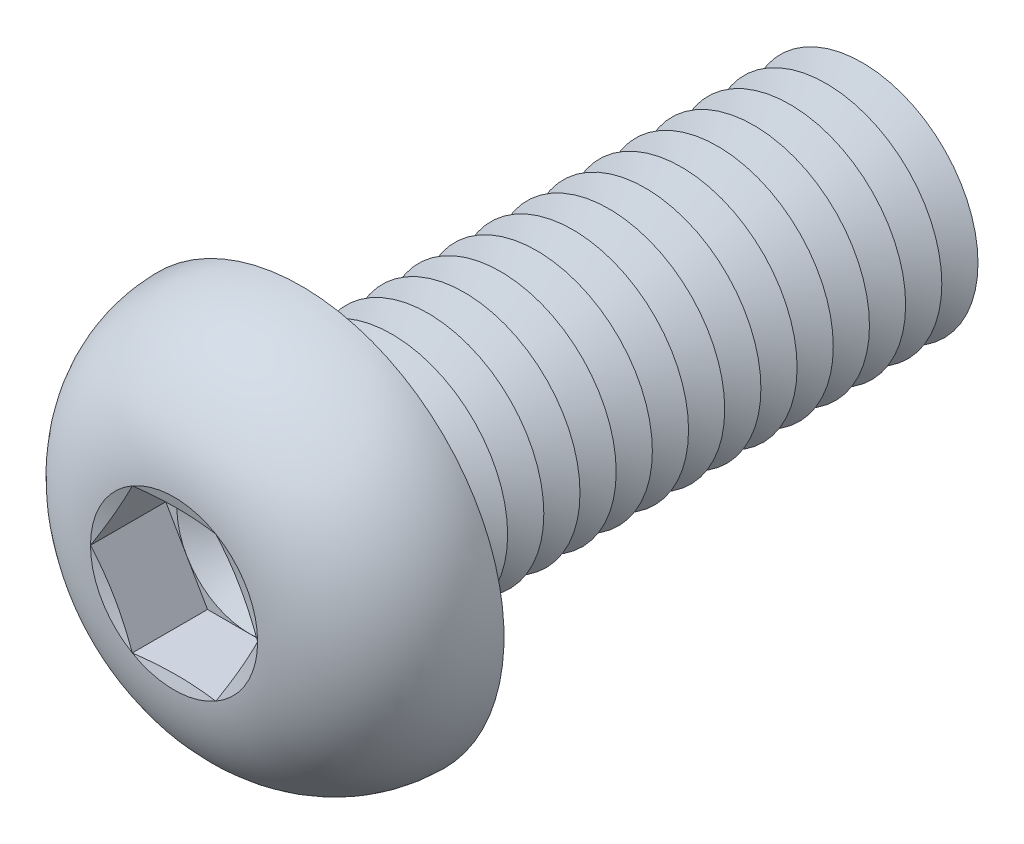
ISO-10303-21;
HEADER;
FILE_DESCRIPTION(('STEP AP214'),'2;1');
FILE_NAME('part.step','',(''),(''),'','','');
FILE_SCHEMA(('AUTOMOTIVE_DESIGN { 1 0 10303 214 1 1 1 1 }'));
ENDSEC;
DATA;
#1=APPLICATION_CONTEXT('core data for automotive mechanical design processes');
#2=APPLICATION_PROTOCOL_DEFINITION('international standard','automotive_design',2000,#1);
#3=PRODUCT_CONTEXT('',#1,'mechanical');
#4=PRODUCT('Part','Part','',(#3));
#5=PRODUCT_RELATED_PRODUCT_CATEGORY('part','',(#4));
#6=PRODUCT_DEFINITION_FORMATION('','',#4);
#7=PRODUCT_DEFINITION_CONTEXT('part definition',#1,'design');
#8=PRODUCT_DEFINITION('design','',#6,#7);
#9=PRODUCT_DEFINITION_SHAPE('','',#8);
#10=(LENGTH_UNIT() NAMED_UNIT(*) SI_UNIT(.MILLI.,.METRE.));
#11=(NAMED_UNIT(*) PLANE_ANGLE_UNIT() SI_UNIT($,.RADIAN.));
#12=(NAMED_UNIT(*) SI_UNIT($,.STERADIAN.) SOLID_ANGLE_UNIT());
#13=UNCERTAINTY_MEASURE_WITH_UNIT(LENGTH_MEASURE(1.E-05),#10,'distance_accuracy_value','');
#14=(GEOMETRIC_REPRESENTATION_CONTEXT(3) GLOBAL_UNCERTAINTY_ASSIGNED_CONTEXT((#13)) GLOBAL_UNIT_ASSIGNED_CONTEXT((#10,
#11,#12)) REPRESENTATION_CONTEXT('',''));
#15=CARTESIAN_POINT('',(0.,0.,0.));
#16=DIRECTION('',(0.,0.,1.));
#17=DIRECTION('',(1.,0.,0.));
#18=AXIS2_PLACEMENT_3D('',#15,#16,#17);
#19=CARTESIAN_POINT('',(0.,0.,1.8));
#20=DIRECTION('',(0.,0.,1.));
#21=DIRECTION('',(1.,0.,0.));
#22=AXIS2_PLACEMENT_3D('',#19,#20,#21);
#23=PLANE('',#22);
#24=CARTESIAN_POINT('',(0.,0.,1.8));
#25=DIRECTION('',(0.,0.,1.));
#26=DIRECTION('',(1.,0.,0.));
#27=AXIS2_PLACEMENT_3D('',#24,#25,#26);
#28=CIRCLE('',#27,2.49999883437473);
#29=CARTESIAN_POINT('',(2.1650625,1.24999941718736,1.8));
#30=VERTEX_POINT('',#29);
#31=CARTESIAN_POINT('',(0.,2.49999883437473,1.8));
#32=VERTEX_POINT('',#31);
#33=EDGE_CURVE('E118',#30,#32,#28,.T.);
#34=ORIENTED_EDGE('',*,*,#33,.F.);
#35=DIRECTION('',(-0.5,0.866025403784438,0.));
#36=VECTOR('',#35,1.);
#37=CARTESIAN_POINT('',(2.88675,0.,1.8));
#38=LINE('',#37,#36);
#39=CARTESIAN_POINT('',(1.443375,2.49999883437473,1.8));
#40=VERTEX_POINT('',#39);
#41=EDGE_CURVE('E125',#30,#40,#38,.T.);
#42=ORIENTED_EDGE('',*,*,#41,.T.);
#43=DIRECTION('',(-1.,0.,0.));
#44=VECTOR('',#43,1.);
#45=CARTESIAN_POINT('',(1.443375,2.49999883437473,1.8));
#46=LINE('',#45,#44);
#47=EDGE_CURVE('E136',#40,#32,#46,.T.);
#48=ORIENTED_EDGE('',*,*,#47,.T.);
#49=EDGE_LOOP('',(#34,#42,#48));
#50=FACE_BOUND('',#49,.T.);
#51=ADVANCED_FACE('F39',(#50),#23,.T.);
#52=CARTESIAN_POINT('',(0.,0.,1.8));
#53=DIRECTION('',(0.,0.,1.));
#54=DIRECTION('',(1.,0.,0.));
#55=AXIS2_PLACEMENT_3D('',#52,#53,#54);
#56=CIRCLE('',#55,2.49999883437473);
#57=CARTESIAN_POINT('',(-2.1650625,1.24999941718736,1.8));
#58=VERTEX_POINT('',#57);
#59=EDGE_CURVE('E11',#32,#58,#56,.T.);
#60=ORIENTED_EDGE('',*,*,#59,.F.);
#61=CARTESIAN_POINT('',(-1.443375,2.49999883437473,1.8));
#62=VERTEX_POINT('',#61);
#63=EDGE_CURVE('E131',#32,#62,#46,.T.);
#64=ORIENTED_EDGE('',*,*,#63,.T.);
#65=DIRECTION('',(-0.5,-0.866025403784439,0.));
#66=VECTOR('',#65,1.);
#67=CARTESIAN_POINT('',(-1.443375,2.49999883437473,1.8));
#68=LINE('',#67,#66);
#69=EDGE_CURVE('E134',#62,#58,#68,.T.);
#70=ORIENTED_EDGE('',*,*,#69,.T.);
#71=EDGE_LOOP('',(#60,#64,#70));
#72=FACE_BOUND('',#71,.T.);
#73=ADVANCED_FACE('F130',(#72),#23,.T.);
#74=CARTESIAN_POINT('',(-2.1650625,-1.24999941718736,1.8));
#75=VERTEX_POINT('',#74);
#76=EDGE_CURVE('E49',#58,#75,#56,.T.);
#77=ORIENTED_EDGE('',*,*,#76,.F.);
#78=CARTESIAN_POINT('',(-2.88675,0.,1.8));
#79=VERTEX_POINT('',#78);
#80=EDGE_CURVE('E143',#58,#79,#68,.T.);
#81=ORIENTED_EDGE('',*,*,#80,.T.);
#82=DIRECTION('',(0.5,-0.866025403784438,0.));
#83=VECTOR('',#82,1.);
#84=CARTESIAN_POINT('',(-2.88675,0.,1.8));
#85=LINE('',#84,#83);
#86=EDGE_CURVE('E152',#79,#75,#85,.T.);
#87=ORIENTED_EDGE('',*,*,#86,.T.);
#88=EDGE_LOOP('',(#77,#81,#87));
#89=FACE_BOUND('',#88,.T.);
#90=ADVANCED_FACE('F395',(#89),#23,.T.);
#91=CARTESIAN_POINT('',(0.,-2.49999883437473,1.8));
#92=VERTEX_POINT('',#91);
#93=EDGE_CURVE('E379',#75,#92,#56,.T.);
#94=ORIENTED_EDGE('',*,*,#93,.F.);
#95=CARTESIAN_POINT('',(-1.443375,-2.49999883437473,1.8));
#96=VERTEX_POINT('',#95);
#97=EDGE_CURVE('E151',#75,#96,#85,.T.);
#98=ORIENTED_EDGE('',*,*,#97,.T.);
#99=DIRECTION('',(1.,0.,0.));
#100=VECTOR('',#99,1.);
#101=CARTESIAN_POINT('',(-1.443375,-2.49999883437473,1.8));
#102=LINE('',#101,#100);
#103=EDGE_CURVE('E157',#96,#92,#102,.T.);
#104=ORIENTED_EDGE('',*,*,#103,.T.);
#105=EDGE_LOOP('',(#94,#98,#104));
#106=FACE_BOUND('',#105,.T.);
#107=ADVANCED_FACE('F389',(#106),#23,.T.);
#108=CARTESIAN_POINT('',(2.1650625,-1.24999941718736,1.8));
#109=VERTEX_POINT('',#108);
#110=EDGE_CURVE('E56',#92,#109,#56,.T.);
#111=ORIENTED_EDGE('',*,*,#110,.F.);
#112=CARTESIAN_POINT('',(1.443375,-2.49999883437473,1.8));
#113=VERTEX_POINT('',#112);
#114=EDGE_CURVE('E156',#92,#113,#102,.T.);
#115=ORIENTED_EDGE('',*,*,#114,.T.);
#116=DIRECTION('',(0.5,0.866025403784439,0.));
#117=VECTOR('',#116,1.);
#118=CARTESIAN_POINT('',(1.443375,-2.49999883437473,1.8));
#119=LINE('',#118,#117);
#120=EDGE_CURVE('E162',#113,#109,#119,.T.);
#121=ORIENTED_EDGE('',*,*,#120,.T.);
#122=EDGE_LOOP('',(#111,#115,#121));
#123=FACE_BOUND('',#122,.T.);
#124=ADVANCED_FACE('F435',(#123),#23,.T.);
#125=CARTESIAN_POINT('',(0.,0.,4.4));
#126=DIRECTION('',(0.,0.,1.));
#127=DIRECTION('',(1.,0.,0.));
#128=AXIS2_PLACEMENT_3D('',#125,#126,#127);
#129=CONICAL_SURFACE('',#128,2.88675,1.30899693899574);
#130=CARTESIAN_POINT('',(2.88686547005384,-0.000199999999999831,4.40003094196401));
#131=CARTESIAN_POINT('',(2.82691617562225,0.103635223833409,4.3839595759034));
#132=CARTESIAN_POINT('',(2.76685817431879,0.207658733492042,4.36936933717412));
#133=CARTESIAN_POINT('',(2.64653003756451,0.416073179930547,4.3437355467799));
#134=CARTESIAN_POINT('',(2.58625982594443,0.520464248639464,4.33269343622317));
#135=CARTESIAN_POINT('',(2.46587274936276,0.728980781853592,4.31480063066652));
#136=CARTESIAN_POINT('',(2.40575669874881,0.833104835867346,4.3079285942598));
#137=CARTESIAN_POINT('',(2.28544792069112,1.0414857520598,4.29871388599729));
#138=CARTESIAN_POINT('',(2.22525521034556,1.14574258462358,4.29637033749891));
#139=CARTESIAN_POINT('',(2.10486978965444,1.35425624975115,4.29637033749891));
#140=CARTESIAN_POINT('',(2.04467707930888,1.45851308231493,4.29871388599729));
#141=CARTESIAN_POINT('',(1.92436830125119,1.66689399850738,4.3079285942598));
#142=CARTESIAN_POINT('',(1.86425225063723,1.77101805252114,4.31480063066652));
#143=CARTESIAN_POINT('',(1.74386517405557,1.97953458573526,4.33269343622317));
#144=CARTESIAN_POINT('',(1.68359496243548,2.08392565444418,4.3437355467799));
#145=CARTESIAN_POINT('',(1.56326682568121,2.29234010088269,4.36936933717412));
#146=CARTESIAN_POINT('',(1.50320882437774,2.39636361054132,4.3839595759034));
#147=CARTESIAN_POINT('',(1.44325952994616,2.50019883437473,4.40003094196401));
#148=B_SPLINE_CURVE_WITH_KNOTS('',3,(#130,#131,#132,#133,#134,#135,#136,#137,#138,#139,#140,
#141,#142,#143,#144,#145,#146,#147),.UNSPECIFIED.,.F.,.F.,(4,2,2,2,2,2,2,2,4),(0.,
0.362931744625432,0.726010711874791,1.08721550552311,1.44835036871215,1.80948523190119,
2.17069002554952,2.53376899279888,2.89670073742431),.UNSPECIFIED.);
#149=CARTESIAN_POINT('',(2.88675,0.,4.4));
#150=VERTEX_POINT('',#149);
#151=CARTESIAN_POINT('',(1.44337499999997,2.49999883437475,4.4));
#152=VERTEX_POINT('',#151);
#153=EDGE_CURVE('E221',#150,#152,#148,.T.);
#154=ORIENTED_EDGE('',*,*,#153,.F.);
#155=CARTESIAN_POINT('',(0.,0.,4.4));
#156=DIRECTION('',(0.,0.,-1.));
#157=DIRECTION('',(-1.,0.,0.));
#158=AXIS2_PLACEMENT_3D('',#155,#156,#157);
#159=CIRCLE('',#158,2.88675);
#160=EDGE_CURVE('E426',#152,#150,#159,.T.);
#161=ORIENTED_EDGE('',*,*,#160,.F.);
#162=EDGE_LOOP('',(#154,#161));
#163=FACE_BOUND('',#162,.T.);
#164=ADVANCED_FACE('F477',(#163),#129,.F.);
#165=CARTESIAN_POINT('',(1.44325952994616,-2.50019883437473,4.40003094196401));
#166=CARTESIAN_POINT('',(1.50320882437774,-2.39636361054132,4.3839595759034));
#167=CARTESIAN_POINT('',(1.56326682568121,-2.29234010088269,4.36936933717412));
#168=CARTESIAN_POINT('',(1.68359496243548,-2.08392565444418,4.3437355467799));
#169=CARTESIAN_POINT('',(1.74386517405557,-1.97953458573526,4.33269343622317));
#170=CARTESIAN_POINT('',(1.86425225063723,-1.77101805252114,4.31480063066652));
#171=CARTESIAN_POINT('',(1.92436830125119,-1.66689399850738,4.3079285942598));
#172=CARTESIAN_POINT('',(2.04467707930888,-1.45851308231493,4.29871388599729));
#173=CARTESIAN_POINT('',(2.10486978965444,-1.35425624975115,4.29637033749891));
#174=CARTESIAN_POINT('',(2.22525521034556,-1.14574258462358,4.29637033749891));
#175=CARTESIAN_POINT('',(2.28544792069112,-1.0414857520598,4.29871388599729));
#176=CARTESIAN_POINT('',(2.40575669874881,-0.833104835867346,4.3079285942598));
#177=CARTESIAN_POINT('',(2.46587274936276,-0.728980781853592,4.31480063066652));
#178=CARTESIAN_POINT('',(2.58625982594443,-0.520464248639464,4.33269343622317));
#179=CARTESIAN_POINT('',(2.64653003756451,-0.416073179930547,4.3437355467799));
#180=CARTESIAN_POINT('',(2.76685817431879,-0.207658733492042,4.36936933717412));
#181=CARTESIAN_POINT('',(2.82691617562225,-0.103635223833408,4.3839595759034));
#182=CARTESIAN_POINT('',(2.88686547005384,0.000200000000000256,4.40003094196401));
#183=B_SPLINE_CURVE_WITH_KNOTS('',3,(#165,#166,#167,#168,#169,#170,#171,#172,#173,#174,#175,
#176,#177,#178,#179,#180,#181,#182),.UNSPECIFIED.,.F.,.F.,(4,2,2,2,2,2,2,2,4),(0.,
0.362931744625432,0.726010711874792,1.08721550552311,1.44835036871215,1.80948523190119,
2.17069002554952,2.53376899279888,2.89670073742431),.UNSPECIFIED.);
#184=CARTESIAN_POINT('',(1.443375,-2.49999883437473,4.4));
#185=VERTEX_POINT('',#184);
#186=EDGE_CURVE('E230',#185,#150,#183,.T.);
#187=ORIENTED_EDGE('',*,*,#186,.F.);
#188=EDGE_CURVE('E428',#150,#185,#159,.T.);
#189=ORIENTED_EDGE('',*,*,#188,.F.);
#190=EDGE_LOOP('',(#187,#189));
#191=FACE_BOUND('',#190,.T.);
#192=ADVANCED_FACE('F482',(#191),#129,.F.);
#193=CARTESIAN_POINT('',(-4.35611719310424,-2.49999883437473,4.97227902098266));
#194=CARTESIAN_POINT('',(-4.25066509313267,-2.49999883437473,4.94777440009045));
#195=CARTESIAN_POINT('',(-4.14516541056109,-2.49999883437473,4.92347459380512));
#196=CARTESIAN_POINT('',(-3.93405094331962,-2.49999883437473,4.87537247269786));
#197=CARTESIAN_POINT('',(-3.82843615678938,-2.49999883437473,4.85157016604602));
#198=CARTESIAN_POINT('',(-3.5113534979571,-2.49999883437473,4.78103338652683));
#199=CARTESIAN_POINT('',(-3.29968815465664,-2.49999883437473,4.73517861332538));
#200=CARTESIAN_POINT('',(-2.87365524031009,-2.49999883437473,4.64645582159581));
#201=CARTESIAN_POINT('',(-2.65928093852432,-2.49999883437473,4.60361983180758));
#202=CARTESIAN_POINT('',(-2.22952626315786,-2.49999883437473,4.52311285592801));
#203=CARTESIAN_POINT('',(-2.01414580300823,-2.49999883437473,4.48544232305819));
#204=CARTESIAN_POINT('',(-1.58798319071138,-2.49999883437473,4.41876559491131));
#205=CARTESIAN_POINT('',(-1.37723418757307,-2.49999883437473,4.38955265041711));
#206=CARTESIAN_POINT('',(-0.954530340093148,-2.49999883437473,4.34171384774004));
#207=CARTESIAN_POINT('',(-0.742575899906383,-2.49999883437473,4.32308463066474));
#208=CARTESIAN_POINT('',(-0.424544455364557,-2.49999883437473,4.30539140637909));
#209=CARTESIAN_POINT('',(-0.318745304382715,-2.49999883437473,4.30120018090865));
#210=CARTESIAN_POINT('',(-0.107062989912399,-2.49999883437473,4.29638997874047));
#211=CARTESIAN_POINT('',(-0.00117982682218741,-2.49999883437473,4.29577098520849));
#212=CARTESIAN_POINT('',(0.210552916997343,-2.49999883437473,4.29814378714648));
#213=CARTESIAN_POINT('',(0.316402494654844,-2.49999883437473,4.30113585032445));
#214=CARTESIAN_POINT('',(0.527944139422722,-2.49999883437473,4.31057322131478));
#215=CARTESIAN_POINT('',(0.633636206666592,-2.49999883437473,4.31701852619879));
#216=CARTESIAN_POINT('',(0.890304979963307,-2.49999883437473,4.33652018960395));
#217=CARTESIAN_POINT('',(1.0411561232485,-2.49999883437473,4.35122885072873));
#218=CARTESIAN_POINT('',(1.34222474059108,-2.49999883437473,4.38593609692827));
#219=CARTESIAN_POINT('',(1.49244223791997,-2.49999883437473,4.40593448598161));
#220=CARTESIAN_POINT('',(1.79273634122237,-2.49999883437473,4.45011321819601));
#221=CARTESIAN_POINT('',(1.94281100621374,-2.49999883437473,4.47430656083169));
#222=CARTESIAN_POINT('',(2.24242097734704,-2.49999883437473,4.52583552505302));
#223=CARTESIAN_POINT('',(2.39195625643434,-2.49999883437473,4.55317130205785));
#224=CARTESIAN_POINT('',(2.69364402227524,-2.49999883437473,4.61079781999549));
#225=CARTESIAN_POINT('',(2.8457870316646,-2.49999883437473,4.64113779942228));
#226=CARTESIAN_POINT('',(3.14969016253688,-2.49999883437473,4.70367638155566));
#227=CARTESIAN_POINT('',(3.30145027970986,-2.49999883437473,4.73587500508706));
#228=CARTESIAN_POINT('',(3.60383766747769,-2.49999883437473,4.80150275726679));
#229=CARTESIAN_POINT('',(3.75446660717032,-2.49999883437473,4.83492423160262));
#230=CARTESIAN_POINT('',(4.05546753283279,-2.49999883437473,4.90285814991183));
#231=CARTESIAN_POINT('',(4.2058395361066,-2.49999883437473,4.9373705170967));
#232=CARTESIAN_POINT('',(4.35611719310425,-2.49999883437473,4.97227902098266));
#233=B_SPLINE_CURVE_WITH_KNOTS('',3,(#193,#194,#195,#196,#197,#198,#199,#200,#201,#202,#203,
#204,#205,#206,#207,#208,#209,#210,#211,#212,#213,#214,#215,#216,#217,#218,#219,#220,#221,#222,
#223,#224,#225,#226,#227,#228,#229,#230,#231,#232),.UNSPECIFIED.,.F.,.F.,(4,2,2,2,2,2,2,2,2,2,2,
2,2,2,2,2,2,2,2,4),(0.,0.324785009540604,0.6495753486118,1.29928181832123,1.95507889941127,
2.61093348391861,3.24905289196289,3.88696967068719,4.204563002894,4.5221548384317,
4.83977022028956,5.15738533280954,5.61196030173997,6.06651842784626,6.52251118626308,
6.97852650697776,7.44392737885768,7.90933346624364,8.37220553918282,8.83504510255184),.UNSPECIFIED.);
#234=CARTESIAN_POINT('',(-1.443375,-2.49999883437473,4.4));
#235=VERTEX_POINT('',#234);
#236=EDGE_CURVE('E407',#235,#185,#233,.T.);
#237=ORIENTED_EDGE('',*,*,#236,.F.);
#238=EDGE_CURVE('E415',#185,#235,#159,.T.);
#239=ORIENTED_EDGE('',*,*,#238,.F.);
#240=EDGE_LOOP('',(#237,#239));
#241=FACE_BOUND('',#240,.T.);
#242=ADVANCED_FACE('F536',(#241),#129,.F.);
#243=CARTESIAN_POINT('',(-2.88686547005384,0.000200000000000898,4.40003094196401));
#244=CARTESIAN_POINT('',(-2.82691617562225,-0.103635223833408,4.3839595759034));
#245=CARTESIAN_POINT('',(-2.76685817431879,-0.207658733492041,4.36936933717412));
#246=CARTESIAN_POINT('',(-2.64653003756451,-0.416073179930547,4.3437355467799));
#247=CARTESIAN_POINT('',(-2.58625982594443,-0.520464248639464,4.33269343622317));
#248=CARTESIAN_POINT('',(-2.46587274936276,-0.728980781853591,4.31480063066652));
#249=CARTESIAN_POINT('',(-2.40575669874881,-0.833104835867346,4.3079285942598));
#250=CARTESIAN_POINT('',(-2.28544792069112,-1.0414857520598,4.29871388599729));
#251=CARTESIAN_POINT('',(-2.22525521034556,-1.14574258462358,4.29637033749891));
#252=CARTESIAN_POINT('',(-2.10486978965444,-1.35425624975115,4.29637033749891));
#253=CARTESIAN_POINT('',(-2.04467707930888,-1.45851308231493,4.29871388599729));
#254=CARTESIAN_POINT('',(-1.92436830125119,-1.66689399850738,4.3079285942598));
#255=CARTESIAN_POINT('',(-1.86425225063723,-1.77101805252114,4.31480063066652));
#256=CARTESIAN_POINT('',(-1.74386517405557,-1.97953458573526,4.33269343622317));
#257=CARTESIAN_POINT('',(-1.68359496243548,-2.08392565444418,4.3437355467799));
#258=CARTESIAN_POINT('',(-1.56326682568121,-2.29234010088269,4.36936933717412));
#259=CARTESIAN_POINT('',(-1.50320882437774,-2.39636361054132,4.3839595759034));
#260=CARTESIAN_POINT('',(-1.44325952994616,-2.50019883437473,4.40003094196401));
#261=B_SPLINE_CURVE_WITH_KNOTS('',3,(#243,#244,#245,#246,#247,#248,#249,#250,#251,#252,#253,
#254,#255,#256,#257,#258,#259,#260),.UNSPECIFIED.,.F.,.F.,(4,2,2,2,2,2,2,2,4),(0.,
0.362931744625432,0.726010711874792,1.08721550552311,1.44835036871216,1.8094852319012,
2.17069002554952,2.53376899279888,2.89670073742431),.UNSPECIFIED.);
#262=CARTESIAN_POINT('',(-2.88675,0.,4.4));
#263=VERTEX_POINT('',#262);
#264=EDGE_CURVE('E400',#263,#235,#261,.T.);
#265=ORIENTED_EDGE('',*,*,#264,.F.);
#266=EDGE_CURVE('E362',#235,#263,#159,.T.);
#267=ORIENTED_EDGE('',*,*,#266,.F.);
#268=EDGE_LOOP('',(#265,#267));
#269=FACE_BOUND('',#268,.T.);
#270=ADVANCED_FACE('F404',(#269),#129,.F.);
#271=CARTESIAN_POINT('',(-1.44325952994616,2.50019883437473,4.40003094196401));
#272=CARTESIAN_POINT('',(-1.50320882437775,2.39636361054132,4.3839595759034));
#273=CARTESIAN_POINT('',(-1.56326682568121,2.29234010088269,4.36936933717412));
#274=CARTESIAN_POINT('',(-1.68359496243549,2.08392565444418,4.3437355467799));
#275=CARTESIAN_POINT('',(-1.74386517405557,1.97953458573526,4.33269343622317));
#276=CARTESIAN_POINT('',(-1.86425225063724,1.77101805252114,4.31480063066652));
#277=CARTESIAN_POINT('',(-1.92436830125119,1.66689399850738,4.3079285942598));
#278=CARTESIAN_POINT('',(-2.04467707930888,1.45851308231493,4.29871388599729));
#279=CARTESIAN_POINT('',(-2.10486978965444,1.35425624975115,4.29637033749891));
#280=CARTESIAN_POINT('',(-2.22525521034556,1.14574258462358,4.29637033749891));
#281=CARTESIAN_POINT('',(-2.28544792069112,1.0414857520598,4.29871388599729));
#282=CARTESIAN_POINT('',(-2.40575669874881,0.833104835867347,4.3079285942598));
#283=CARTESIAN_POINT('',(-2.46587274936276,0.728980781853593,4.31480063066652));
#284=CARTESIAN_POINT('',(-2.58625982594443,0.520464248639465,4.33269343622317));
#285=CARTESIAN_POINT('',(-2.64653003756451,0.416073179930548,4.3437355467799));
#286=CARTESIAN_POINT('',(-2.76685817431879,0.207658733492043,4.36936933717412));
#287=CARTESIAN_POINT('',(-2.82691617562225,0.10363522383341,4.3839595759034));
#288=CARTESIAN_POINT('',(-2.88686547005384,-0.000199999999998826,4.40003094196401));
#289=B_SPLINE_CURVE_WITH_KNOTS('',3,(#271,#272,#273,#274,#275,#276,#277,#278,#279,#280,#281,
#282,#283,#284,#285,#286,#287,#288),.UNSPECIFIED.,.F.,.F.,(4,2,2,2,2,2,2,2,4),(0.,
0.362931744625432,0.726010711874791,1.08721550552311,1.44835036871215,1.80948523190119,
2.17069002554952,2.53376899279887,2.89670073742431),.UNSPECIFIED.);
#290=CARTESIAN_POINT('',(-1.443375,2.49999883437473,4.4));
#291=VERTEX_POINT('',#290);
#292=EDGE_CURVE('E195',#291,#263,#289,.T.);
#293=ORIENTED_EDGE('',*,*,#292,.F.);
#294=EDGE_CURVE('E363',#263,#291,#159,.T.);
#295=ORIENTED_EDGE('',*,*,#294,.F.);
#296=EDGE_LOOP('',(#293,#295));
#297=FACE_BOUND('',#296,.T.);
#298=ADVANCED_FACE('F418',(#297),#129,.F.);
#299=CARTESIAN_POINT('',(0.,0.,-15.625));
#300=DIRECTION('',(0.,0.,1.));
#301=DIRECTION('',(1.,0.,0.));
#302=AXIS2_PLACEMENT_3D('',#299,#300,#301);
#303=CONICAL_SURFACE('',#302,4.00000000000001,1.0471975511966);
#304=CARTESIAN_POINT('',(0.,0.,-16.25));
#305=DIRECTION('',(0.,0.,1.));
#306=DIRECTION('',(1.,0.,0.));
#307=AXIS2_PLACEMENT_3D('',#304,#305,#306);
#308=CIRCLE('',#307,2.91746824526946);
#309=CARTESIAN_POINT('',(2.91746824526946,0.,-16.25));
#310=VERTEX_POINT('',#309);
#311=EDGE_CURVE('E334',#310,#310,#308,.T.);
#312=ORIENTED_EDGE('',*,*,#311,.T.);
#313=EDGE_LOOP('',(#312));
#314=FACE_BOUND('',#313,.T.);
#315=CARTESIAN_POINT('',(0.,0.,-15.625));
#316=DIRECTION('',(0.,0.,1.));
#317=DIRECTION('',(1.,0.,0.));
#318=AXIS2_PLACEMENT_3D('',#315,#316,#317);
#319=CIRCLE('',#318,4.00000000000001);
#320=CARTESIAN_POINT('',(4.00000000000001,0.,-15.625));
#321=VERTEX_POINT('',#320);
#322=EDGE_CURVE('E330',#321,#321,#319,.T.);
#323=ORIENTED_EDGE('',*,*,#322,.F.);
#324=EDGE_LOOP('',(#323));
#325=FACE_BOUND('',#324,.T.);
#326=ADVANCED_FACE('F526',(#314,#325),#303,.T.);
#327=CARTESIAN_POINT('',(0.,0.,-16.25));
#328=DIRECTION('',(0.,0.,-1.));
#329=DIRECTION('',(-1.,0.,0.));
#330=AXIS2_PLACEMENT_3D('',#327,#328,#329);
#331=CONICAL_SURFACE('',#330,2.91746824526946,1.0471975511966);
#332=CARTESIAN_POINT('',(0.,0.,-16.875));
#333=DIRECTION('',(0.,0.,1.));
#334=DIRECTION('',(1.,0.,0.));
#335=AXIS2_PLACEMENT_3D('',#332,#333,#334);
#336=CIRCLE('',#335,4.00000000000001);
#337=CARTESIAN_POINT('',(4.00000000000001,0.,-16.875));
#338=VERTEX_POINT('',#337);
#339=EDGE_CURVE('E338',#338,#338,#336,.T.);
#340=ORIENTED_EDGE('',*,*,#339,.T.);
#341=EDGE_LOOP('',(#340));
#342=FACE_BOUND('',#341,.T.);
#343=ORIENTED_EDGE('',*,*,#311,.F.);
#344=EDGE_LOOP('',(#343));
#345=FACE_BOUND('',#344,.T.);
#346=ADVANCED_FACE('F840',(#342,#345),#331,.T.);
#347=CARTESIAN_POINT('',(0.,4.00000000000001,-20.));
#348=DIRECTION('',(0.,0.,-1.));
#349=DIRECTION('',(-1.,0.,0.));
#350=AXIS2_PLACEMENT_3D('',#347,#348,#349);
#351=PLANE('',#350);
#352=CARTESIAN_POINT('',(0.,0.,-20.));
#353=DIRECTION('',(0.,0.,1.));
#354=DIRECTION('',(1.,0.,0.));
#355=AXIS2_PLACEMENT_3D('',#352,#353,#354);
#356=CIRCLE('',#355,2.91746824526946);
#357=CARTESIAN_POINT('',(2.91746824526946,0.,-20.));
#358=VERTEX_POINT('',#357);
#359=EDGE_CURVE('E358',#358,#358,#356,.T.);
#360=ORIENTED_EDGE('',*,*,#359,.F.);
#361=EDGE_LOOP('',(#360));
#362=FACE_BOUND('',#361,.T.);
#363=ADVANCED_FACE('F845',(#362),#351,.T.);
#364=CARTESIAN_POINT('',(0.,0.,-19.375));
#365=DIRECTION('',(0.,0.,1.));
#366=DIRECTION('',(1.,0.,0.));
#367=AXIS2_PLACEMENT_3D('',#364,#365,#366);
#368=CONICAL_SURFACE('',#367,4.00000000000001,1.0471975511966);
#369=ORIENTED_EDGE('',*,*,#359,.T.);
#370=EDGE_LOOP('',(#369));
#371=FACE_BOUND('',#370,.T.);
#372=CARTESIAN_POINT('',(0.,0.,-19.375));
#373=DIRECTION('',(0.,0.,1.));
#374=DIRECTION('',(1.,0.,0.));
#375=AXIS2_PLACEMENT_3D('',#372,#373,#374);
#376=CIRCLE('',#375,4.00000000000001);
#377=CARTESIAN_POINT('',(4.00000000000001,0.,-19.375));
#378=VERTEX_POINT('',#377);
#379=EDGE_CURVE('E354',#378,#378,#376,.T.);
#380=ORIENTED_EDGE('',*,*,#379,.F.);
#381=EDGE_LOOP('',(#380));
#382=FACE_BOUND('',#381,.T.);
#383=ADVANCED_FACE('F833',(#371,#382),#368,.T.);
#384=CARTESIAN_POINT('',(0.,0.,-18.75));
#385=DIRECTION('',(0.,0.,-1.));
#386=DIRECTION('',(-1.,0.,0.));
#387=AXIS2_PLACEMENT_3D('',#384,#385,#386);
#388=CONICAL_SURFACE('',#387,2.91746824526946,1.0471975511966);
#389=ORIENTED_EDGE('',*,*,#379,.T.);
#390=EDGE_LOOP('',(#389));
#391=FACE_BOUND('',#390,.T.);
#392=CARTESIAN_POINT('',(0.,0.,-18.75));
#393=DIRECTION('',(0.,0.,1.));
#394=DIRECTION('',(1.,0.,0.));
#395=AXIS2_PLACEMENT_3D('',#392,#393,#394);
#396=CIRCLE('',#395,2.91746824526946);
#397=CARTESIAN_POINT('',(2.91746824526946,0.,-18.75));
#398=VERTEX_POINT('',#397);
#399=EDGE_CURVE('E350',#398,#398,#396,.T.);
#400=ORIENTED_EDGE('',*,*,#399,.F.);
#401=EDGE_LOOP('',(#400));
#402=FACE_BOUND('',#401,.T.);
#403=ADVANCED_FACE('F823',(#391,#402),#388,.T.);
#404=CARTESIAN_POINT('',(0.,0.,-18.125));
#405=DIRECTION('',(0.,0.,1.));
#406=DIRECTION('',(1.,0.,0.));
#407=AXIS2_PLACEMENT_3D('',#404,#405,#406);
#408=CONICAL_SURFACE('',#407,4.00000000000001,1.0471975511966);
#409=ORIENTED_EDGE('',*,*,#399,.T.);
#410=EDGE_LOOP('',(#409));
#411=FACE_BOUND('',#410,.T.);
#412=CARTESIAN_POINT('',(0.,0.,-18.125));
#413=DIRECTION('',(0.,0.,1.));
#414=DIRECTION('',(1.,0.,0.));
#415=AXIS2_PLACEMENT_3D('',#412,#413,#414);
#416=CIRCLE('',#415,4.00000000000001);
#417=CARTESIAN_POINT('',(4.00000000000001,0.,-18.125));
#418=VERTEX_POINT('',#417);
#419=EDGE_CURVE('E346',#418,#418,#416,.T.);
#420=ORIENTED_EDGE('',*,*,#419,.F.);
#421=EDGE_LOOP('',(#420));
#422=FACE_BOUND('',#421,.T.);
#423=ADVANCED_FACE('F813',(#411,#422),#408,.T.);
#424=CARTESIAN_POINT('',(0.,0.,-17.5));
#425=DIRECTION('',(0.,0.,-1.));
#426=DIRECTION('',(-1.,0.,0.));
#427=AXIS2_PLACEMENT_3D('',#424,#425,#426);
#428=CONICAL_SURFACE('',#427,2.91746824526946,1.0471975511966);
#429=ORIENTED_EDGE('',*,*,#419,.T.);
#430=EDGE_LOOP('',(#429));
#431=FACE_BOUND('',#430,.T.);
#432=CARTESIAN_POINT('',(0.,0.,-17.5));
#433=DIRECTION('',(0.,0.,1.));
#434=DIRECTION('',(1.,0.,0.));
#435=AXIS2_PLACEMENT_3D('',#432,#433,#434);
#436=CIRCLE('',#435,2.91746824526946);
#437=CARTESIAN_POINT('',(2.91746824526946,0.,-17.5));
#438=VERTEX_POINT('',#437);
#439=EDGE_CURVE('E342',#438,#438,#436,.T.);
#440=ORIENTED_EDGE('',*,*,#439,.F.);
#441=EDGE_LOOP('',(#440));
#442=FACE_BOUND('',#441,.T.);
#443=ADVANCED_FACE('F803',(#431,#442),#428,.T.);
#444=CARTESIAN_POINT('',(0.,0.,-16.875));
#445=DIRECTION('',(0.,0.,1.));
#446=DIRECTION('',(1.,0.,0.));
#447=AXIS2_PLACEMENT_3D('',#444,#445,#446);
#448=CONICAL_SURFACE('',#447,4.00000000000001,1.0471975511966);
#449=ORIENTED_EDGE('',*,*,#439,.T.);
#450=EDGE_LOOP('',(#449));
#451=FACE_BOUND('',#450,.T.);
#452=ORIENTED_EDGE('',*,*,#339,.F.);
#453=EDGE_LOOP('',(#452));
#454=FACE_BOUND('',#453,.T.);
#455=ADVANCED_FACE('F793',(#451,#454),#448,.T.);
#456=CARTESIAN_POINT('',(0.,0.,-14.375));
#457=DIRECTION('',(0.,0.,1.));
#458=DIRECTION('',(1.,0.,0.));
#459=AXIS2_PLACEMENT_3D('',#456,#457,#458);
#460=CONICAL_SURFACE('',#459,4.00000000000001,1.0471975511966);
#461=CARTESIAN_POINT('',(0.,0.,-15.));
#462=DIRECTION('',(0.,0.,1.));
#463=DIRECTION('',(1.,0.,0.));
#464=AXIS2_PLACEMENT_3D('',#461,#462,#463);
#465=CIRCLE('',#464,2.91746824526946);
#466=CARTESIAN_POINT('',(2.91746824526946,0.,-15.));
#467=VERTEX_POINT('',#466);
#468=EDGE_CURVE('E326',#467,#467,#465,.T.);
#469=ORIENTED_EDGE('',*,*,#468,.T.);
#470=EDGE_LOOP('',(#469));
#471=FACE_BOUND('',#470,.T.);
#472=CARTESIAN_POINT('',(0.,0.,-14.375));
#473=DIRECTION('',(0.,0.,1.));
#474=DIRECTION('',(1.,0.,0.));
#475=AXIS2_PLACEMENT_3D('',#472,#473,#474);
#476=CIRCLE('',#475,4.00000000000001);
#477=CARTESIAN_POINT('',(4.00000000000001,0.,-14.375));
#478=VERTEX_POINT('',#477);
#479=EDGE_CURVE('E322',#478,#478,#476,.T.);
#480=ORIENTED_EDGE('',*,*,#479,.F.);
#481=EDGE_LOOP('',(#480));
#482=FACE_BOUND('',#481,.T.);
#483=ADVANCED_FACE('F783',(#471,#482),#460,.T.);
#484=CARTESIAN_POINT('',(0.,0.,-15.));
#485=DIRECTION('',(0.,0.,-1.));
#486=DIRECTION('',(-1.,0.,0.));
#487=AXIS2_PLACEMENT_3D('',#484,#485,#486);
#488=CONICAL_SURFACE('',#487,2.91746824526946,1.0471975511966);
#489=ORIENTED_EDGE('',*,*,#322,.T.);
#490=EDGE_LOOP('',(#489));
#491=FACE_BOUND('',#490,.T.);
#492=ORIENTED_EDGE('',*,*,#468,.F.);
#493=EDGE_LOOP('',(#492));
#494=FACE_BOUND('',#493,.T.);
#495=ADVANCED_FACE('F773',(#491,#494),#488,.T.);
#496=CARTESIAN_POINT('',(0.,0.,-13.125));
#497=DIRECTION('',(0.,0.,1.));
#498=DIRECTION('',(1.,0.,0.));
#499=AXIS2_PLACEMENT_3D('',#496,#497,#498);
#500=CONICAL_SURFACE('',#499,4.00000000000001,1.0471975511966);
#501=CARTESIAN_POINT('',(0.,0.,-13.75));
#502=DIRECTION('',(0.,0.,1.));
#503=DIRECTION('',(1.,0.,0.));
#504=AXIS2_PLACEMENT_3D('',#501,#502,#503);
#505=CIRCLE('',#504,2.91746824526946);
#506=CARTESIAN_POINT('',(2.91746824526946,0.,-13.75));
#507=VERTEX_POINT('',#506);
#508=EDGE_CURVE('E318',#507,#507,#505,.T.);
#509=ORIENTED_EDGE('',*,*,#508,.T.);
#510=EDGE_LOOP('',(#509));
#511=FACE_BOUND('',#510,.T.);
#512=CARTESIAN_POINT('',(0.,0.,-13.125));
#513=DIRECTION('',(0.,0.,1.));
#514=DIRECTION('',(1.,0.,0.));
#515=AXIS2_PLACEMENT_3D('',#512,#513,#514);
#516=CIRCLE('',#515,4.00000000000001);
#517=CARTESIAN_POINT('',(4.00000000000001,0.,-13.125));
#518=VERTEX_POINT('',#517);
#519=EDGE_CURVE('E314',#518,#518,#516,.T.);
#520=ORIENTED_EDGE('',*,*,#519,.F.);
#521=EDGE_LOOP('',(#520));
#522=FACE_BOUND('',#521,.T.);
#523=ADVANCED_FACE('F763',(#511,#522),#500,.T.);
#524=CARTESIAN_POINT('',(0.,0.,-13.75));
#525=DIRECTION('',(0.,0.,-1.));
#526=DIRECTION('',(-1.,0.,0.));
#527=AXIS2_PLACEMENT_3D('',#524,#525,#526);
#528=CONICAL_SURFACE('',#527,2.91746824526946,1.0471975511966);
#529=ORIENTED_EDGE('',*,*,#479,.T.);
#530=EDGE_LOOP('',(#529));
#531=FACE_BOUND('',#530,.T.);
#532=ORIENTED_EDGE('',*,*,#508,.F.);
#533=EDGE_LOOP('',(#532));
#534=FACE_BOUND('',#533,.T.);
#535=ADVANCED_FACE('F753',(#531,#534),#528,.T.);
#536=CARTESIAN_POINT('',(0.,0.,-11.875));
#537=DIRECTION('',(0.,0.,1.));
#538=DIRECTION('',(1.,0.,0.));
#539=AXIS2_PLACEMENT_3D('',#536,#537,#538);
#540=CONICAL_SURFACE('',#539,4.00000000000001,1.0471975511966);
#541=CARTESIAN_POINT('',(0.,0.,-12.5));
#542=DIRECTION('',(0.,0.,1.));
#543=DIRECTION('',(1.,0.,0.));
#544=AXIS2_PLACEMENT_3D('',#541,#542,#543);
#545=CIRCLE('',#544,2.91746824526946);
#546=CARTESIAN_POINT('',(2.91746824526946,0.,-12.5));
#547=VERTEX_POINT('',#546);
#548=EDGE_CURVE('E310',#547,#547,#545,.T.);
#549=ORIENTED_EDGE('',*,*,#548,.T.);
#550=EDGE_LOOP('',(#549));
#551=FACE_BOUND('',#550,.T.);
#552=CARTESIAN_POINT('',(0.,0.,-11.875));
#553=DIRECTION('',(0.,0.,1.));
#554=DIRECTION('',(1.,0.,0.));
#555=AXIS2_PLACEMENT_3D('',#552,#553,#554);
#556=CIRCLE('',#555,4.00000000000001);
#557=CARTESIAN_POINT('',(4.00000000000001,0.,-11.875));
#558=VERTEX_POINT('',#557);
#559=EDGE_CURVE('E306',#558,#558,#556,.T.);
#560=ORIENTED_EDGE('',*,*,#559,.F.);
#561=EDGE_LOOP('',(#560));
#562=FACE_BOUND('',#561,.T.);
#563=ADVANCED_FACE('F743',(#551,#562),#540,.T.);
#564=CARTESIAN_POINT('',(0.,0.,-12.5));
#565=DIRECTION('',(0.,0.,-1.));
#566=DIRECTION('',(-1.,0.,0.));
#567=AXIS2_PLACEMENT_3D('',#564,#565,#566);
#568=CONICAL_SURFACE('',#567,2.91746824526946,1.0471975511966);
#569=ORIENTED_EDGE('',*,*,#519,.T.);
#570=EDGE_LOOP('',(#569));
#571=FACE_BOUND('',#570,.T.);
#572=ORIENTED_EDGE('',*,*,#548,.F.);
#573=EDGE_LOOP('',(#572));
#574=FACE_BOUND('',#573,.T.);
#575=ADVANCED_FACE('F733',(#571,#574),#568,.T.);
#576=CARTESIAN_POINT('',(0.,0.,-10.625));
#577=DIRECTION('',(0.,0.,1.));
#578=DIRECTION('',(1.,0.,0.));
#579=AXIS2_PLACEMENT_3D('',#576,#577,#578);
#580=CONICAL_SURFACE('',#579,4.00000000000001,1.0471975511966);
#581=CARTESIAN_POINT('',(0.,0.,-11.25));
#582=DIRECTION('',(0.,0.,1.));
#583=DIRECTION('',(1.,0.,0.));
#584=AXIS2_PLACEMENT_3D('',#581,#582,#583);
#585=CIRCLE('',#584,2.91746824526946);
#586=CARTESIAN_POINT('',(2.91746824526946,0.,-11.25));
#587=VERTEX_POINT('',#586);
#588=EDGE_CURVE('E302',#587,#587,#585,.T.);
#589=ORIENTED_EDGE('',*,*,#588,.T.);
#590=EDGE_LOOP('',(#589));
#591=FACE_BOUND('',#590,.T.);
#592=CARTESIAN_POINT('',(0.,0.,-10.625));
#593=DIRECTION('',(0.,0.,1.));
#594=DIRECTION('',(1.,0.,0.));
#595=AXIS2_PLACEMENT_3D('',#592,#593,#594);
#596=CIRCLE('',#595,4.00000000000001);
#597=CARTESIAN_POINT('',(4.00000000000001,0.,-10.625));
#598=VERTEX_POINT('',#597);
#599=EDGE_CURVE('E298',#598,#598,#596,.T.);
#600=ORIENTED_EDGE('',*,*,#599,.F.);
#601=EDGE_LOOP('',(#600));
#602=FACE_BOUND('',#601,.T.);
#603=ADVANCED_FACE('F723',(#591,#602),#580,.T.);
#604=CARTESIAN_POINT('',(0.,0.,-11.25));
#605=DIRECTION('',(0.,0.,-1.));
#606=DIRECTION('',(-1.,0.,0.));
#607=AXIS2_PLACEMENT_3D('',#604,#605,#606);
#608=CONICAL_SURFACE('',#607,2.91746824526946,1.0471975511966);
#609=ORIENTED_EDGE('',*,*,#559,.T.);
#610=EDGE_LOOP('',(#609));
#611=FACE_BOUND('',#610,.T.);
#612=ORIENTED_EDGE('',*,*,#588,.F.);
#613=EDGE_LOOP('',(#612));
#614=FACE_BOUND('',#613,.T.);
#615=ADVANCED_FACE('F713',(#611,#614),#608,.T.);
#616=CARTESIAN_POINT('',(0.,0.,-9.375));
#617=DIRECTION('',(0.,0.,1.));
#618=DIRECTION('',(1.,0.,0.));
#619=AXIS2_PLACEMENT_3D('',#616,#617,#618);
#620=CONICAL_SURFACE('',#619,4.00000000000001,1.0471975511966);
#621=CARTESIAN_POINT('',(0.,0.,-10.));
#622=DIRECTION('',(0.,0.,1.));
#623=DIRECTION('',(1.,0.,0.));
#624=AXIS2_PLACEMENT_3D('',#621,#622,#623);
#625=CIRCLE('',#624,2.91746824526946);
#626=CARTESIAN_POINT('',(2.91746824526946,0.,-10.));
#627=VERTEX_POINT('',#626);
#628=EDGE_CURVE('E294',#627,#627,#625,.T.);
#629=ORIENTED_EDGE('',*,*,#628,.T.);
#630=EDGE_LOOP('',(#629));
#631=FACE_BOUND('',#630,.T.);
#632=CARTESIAN_POINT('',(0.,0.,-9.375));
#633=DIRECTION('',(0.,0.,1.));
#634=DIRECTION('',(1.,0.,0.));
#635=AXIS2_PLACEMENT_3D('',#632,#633,#634);
#636=CIRCLE('',#635,4.00000000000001);
#637=CARTESIAN_POINT('',(4.00000000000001,0.,-9.375));
#638=VERTEX_POINT('',#637);
#639=EDGE_CURVE('E290',#638,#638,#636,.T.);
#640=ORIENTED_EDGE('',*,*,#639,.F.);
#641=EDGE_LOOP('',(#640));
#642=FACE_BOUND('',#641,.T.);
#643=ADVANCED_FACE('F703',(#631,#642),#620,.T.);
#644=CARTESIAN_POINT('',(0.,0.,-10.));
#645=DIRECTION('',(0.,0.,-1.));
#646=DIRECTION('',(-1.,0.,0.));
#647=AXIS2_PLACEMENT_3D('',#644,#645,#646);
#648=CONICAL_SURFACE('',#647,2.91746824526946,1.0471975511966);
#649=ORIENTED_EDGE('',*,*,#599,.T.);
#650=EDGE_LOOP('',(#649));
#651=FACE_BOUND('',#650,.T.);
#652=ORIENTED_EDGE('',*,*,#628,.F.);
#653=EDGE_LOOP('',(#652));
#654=FACE_BOUND('',#653,.T.);
#655=ADVANCED_FACE('F693',(#651,#654),#648,.T.);
#656=CARTESIAN_POINT('',(0.,0.,-8.125));
#657=DIRECTION('',(0.,0.,1.));
#658=DIRECTION('',(1.,0.,0.));
#659=AXIS2_PLACEMENT_3D('',#656,#657,#658);
#660=CONICAL_SURFACE('',#659,4.00000000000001,1.0471975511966);
#661=CARTESIAN_POINT('',(0.,0.,-8.75));
#662=DIRECTION('',(0.,0.,1.));
#663=DIRECTION('',(1.,0.,0.));
#664=AXIS2_PLACEMENT_3D('',#661,#662,#663);
#665=CIRCLE('',#664,2.91746824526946);
#666=CARTESIAN_POINT('',(2.91746824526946,0.,-8.75));
#667=VERTEX_POINT('',#666);
#668=EDGE_CURVE('E286',#667,#667,#665,.T.);
#669=ORIENTED_EDGE('',*,*,#668,.T.);
#670=EDGE_LOOP('',(#669));
#671=FACE_BOUND('',#670,.T.);
#672=CARTESIAN_POINT('',(0.,0.,-8.125));
#673=DIRECTION('',(0.,0.,1.));
#674=DIRECTION('',(1.,0.,0.));
#675=AXIS2_PLACEMENT_3D('',#672,#673,#674);
#676=CIRCLE('',#675,4.00000000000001);
#677=CARTESIAN_POINT('',(4.00000000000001,0.,-8.125));
#678=VERTEX_POINT('',#677);
#679=EDGE_CURVE('E282',#678,#678,#676,.T.);
#680=ORIENTED_EDGE('',*,*,#679,.F.);
#681=EDGE_LOOP('',(#680));
#682=FACE_BOUND('',#681,.T.);
#683=ADVANCED_FACE('F683',(#671,#682),#660,.T.);
#684=CARTESIAN_POINT('',(0.,0.,-8.75));
#685=DIRECTION('',(0.,0.,-1.));
#686=DIRECTION('',(-1.,0.,0.));
#687=AXIS2_PLACEMENT_3D('',#684,#685,#686);
#688=CONICAL_SURFACE('',#687,2.91746824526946,1.0471975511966);
#689=ORIENTED_EDGE('',*,*,#639,.T.);
#690=EDGE_LOOP('',(#689));
#691=FACE_BOUND('',#690,.T.);
#692=ORIENTED_EDGE('',*,*,#668,.F.);
#693=EDGE_LOOP('',(#692));
#694=FACE_BOUND('',#693,.T.);
#695=ADVANCED_FACE('F673',(#691,#694),#688,.T.);
#696=CARTESIAN_POINT('',(0.,0.,-6.875));
#697=DIRECTION('',(0.,0.,1.));
#698=DIRECTION('',(1.,0.,0.));
#699=AXIS2_PLACEMENT_3D('',#696,#697,#698);
#700=CONICAL_SURFACE('',#699,4.00000000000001,1.0471975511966);
#701=CARTESIAN_POINT('',(0.,0.,-7.5));
#702=DIRECTION('',(0.,0.,1.));
#703=DIRECTION('',(1.,0.,0.));
#704=AXIS2_PLACEMENT_3D('',#701,#702,#703);
#705=CIRCLE('',#704,2.91746824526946);
#706=CARTESIAN_POINT('',(2.91746824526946,0.,-7.5));
#707=VERTEX_POINT('',#706);
#708=EDGE_CURVE('E278',#707,#707,#705,.T.);
#709=ORIENTED_EDGE('',*,*,#708,.T.);
#710=EDGE_LOOP('',(#709));
#711=FACE_BOUND('',#710,.T.);
#712=CARTESIAN_POINT('',(0.,0.,-6.875));
#713=DIRECTION('',(0.,0.,1.));
#714=DIRECTION('',(1.,0.,0.));
#715=AXIS2_PLACEMENT_3D('',#712,#713,#714);
#716=CIRCLE('',#715,4.00000000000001);
#717=CARTESIAN_POINT('',(4.00000000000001,0.,-6.875));
#718=VERTEX_POINT('',#717);
#719=EDGE_CURVE('E274',#718,#718,#716,.T.);
#720=ORIENTED_EDGE('',*,*,#719,.F.);
#721=EDGE_LOOP('',(#720));
#722=FACE_BOUND('',#721,.T.);
#723=ADVANCED_FACE('F663',(#711,#722),#700,.T.);
#724=CARTESIAN_POINT('',(0.,0.,-7.5));
#725=DIRECTION('',(0.,0.,-1.));
#726=DIRECTION('',(-1.,0.,0.));
#727=AXIS2_PLACEMENT_3D('',#724,#725,#726);
#728=CONICAL_SURFACE('',#727,2.91746824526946,1.0471975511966);
#729=ORIENTED_EDGE('',*,*,#679,.T.);
#730=EDGE_LOOP('',(#729));
#731=FACE_BOUND('',#730,.T.);
#732=ORIENTED_EDGE('',*,*,#708,.F.);
#733=EDGE_LOOP('',(#732));
#734=FACE_BOUND('',#733,.T.);
#735=ADVANCED_FACE('F653',(#731,#734),#728,.T.);
#736=CARTESIAN_POINT('',(0.,0.,-5.625));
#737=DIRECTION('',(0.,0.,1.));
#738=DIRECTION('',(1.,0.,0.));
#739=AXIS2_PLACEMENT_3D('',#736,#737,#738);
#740=CONICAL_SURFACE('',#739,4.00000000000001,1.0471975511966);
#741=CARTESIAN_POINT('',(0.,0.,-6.25));
#742=DIRECTION('',(0.,0.,1.));
#743=DIRECTION('',(1.,0.,0.));
#744=AXIS2_PLACEMENT_3D('',#741,#742,#743);
#745=CIRCLE('',#744,2.91746824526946);
#746=CARTESIAN_POINT('',(2.91746824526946,0.,-6.25));
#747=VERTEX_POINT('',#746);
#748=EDGE_CURVE('E270',#747,#747,#745,.T.);
#749=ORIENTED_EDGE('',*,*,#748,.T.);
#750=EDGE_LOOP('',(#749));
#751=FACE_BOUND('',#750,.T.);
#752=CARTESIAN_POINT('',(0.,0.,-5.625));
#753=DIRECTION('',(0.,0.,1.));
#754=DIRECTION('',(1.,0.,0.));
#755=AXIS2_PLACEMENT_3D('',#752,#753,#754);
#756=CIRCLE('',#755,4.00000000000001);
#757=CARTESIAN_POINT('',(4.00000000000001,0.,-5.625));
#758=VERTEX_POINT('',#757);
#759=EDGE_CURVE('E266',#758,#758,#756,.T.);
#760=ORIENTED_EDGE('',*,*,#759,.F.);
#761=EDGE_LOOP('',(#760));
#762=FACE_BOUND('',#761,.T.);
#763=ADVANCED_FACE('F643',(#751,#762),#740,.T.);
#764=CARTESIAN_POINT('',(0.,0.,-6.25));
#765=DIRECTION('',(0.,0.,-1.));
#766=DIRECTION('',(-1.,0.,0.));
#767=AXIS2_PLACEMENT_3D('',#764,#765,#766);
#768=CONICAL_SURFACE('',#767,2.91746824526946,1.0471975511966);
#769=ORIENTED_EDGE('',*,*,#719,.T.);
#770=EDGE_LOOP('',(#769));
#771=FACE_BOUND('',#770,.T.);
#772=ORIENTED_EDGE('',*,*,#748,.F.);
#773=EDGE_LOOP('',(#772));
#774=FACE_BOUND('',#773,.T.);
#775=ADVANCED_FACE('F633',(#771,#774),#768,.T.);
#776=CARTESIAN_POINT('',(0.,0.,-4.375));
#777=DIRECTION('',(0.,0.,1.));
#778=DIRECTION('',(1.,0.,0.));
#779=AXIS2_PLACEMENT_3D('',#776,#777,#778);
#780=CONICAL_SURFACE('',#779,4.00000000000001,1.0471975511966);
#781=CARTESIAN_POINT('',(0.,0.,-5.));
#782=DIRECTION('',(0.,0.,1.));
#783=DIRECTION('',(1.,0.,0.));
#784=AXIS2_PLACEMENT_3D('',#781,#782,#783);
#785=CIRCLE('',#784,2.91746824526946);
#786=CARTESIAN_POINT('',(2.91746824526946,0.,-5.));
#787=VERTEX_POINT('',#786);
#788=EDGE_CURVE('E262',#787,#787,#785,.T.);
#789=ORIENTED_EDGE('',*,*,#788,.T.);
#790=EDGE_LOOP('',(#789));
#791=FACE_BOUND('',#790,.T.);
#792=CARTESIAN_POINT('',(0.,0.,-4.375));
#793=DIRECTION('',(0.,0.,1.));
#794=DIRECTION('',(1.,0.,0.));
#795=AXIS2_PLACEMENT_3D('',#792,#793,#794);
#796=CIRCLE('',#795,4.00000000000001);
#797=CARTESIAN_POINT('',(4.00000000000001,0.,-4.375));
#798=VERTEX_POINT('',#797);
#799=EDGE_CURVE('E259',#798,#798,#796,.T.);
#800=ORIENTED_EDGE('',*,*,#799,.F.);
#801=EDGE_LOOP('',(#800));
#802=FACE_BOUND('',#801,.T.);
#803=ADVANCED_FACE('F623',(#791,#802),#780,.T.);
#804=CARTESIAN_POINT('',(0.,0.,-5.));
#805=DIRECTION('',(0.,0.,-1.));
#806=DIRECTION('',(-1.,0.,0.));
#807=AXIS2_PLACEMENT_3D('',#804,#805,#806);
#808=CONICAL_SURFACE('',#807,2.91746824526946,1.0471975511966);
#809=ORIENTED_EDGE('',*,*,#759,.T.);
#810=EDGE_LOOP('',(#809));
#811=FACE_BOUND('',#810,.T.);
#812=ORIENTED_EDGE('',*,*,#788,.F.);
#813=EDGE_LOOP('',(#812));
#814=FACE_BOUND('',#813,.T.);
#815=ADVANCED_FACE('F613',(#811,#814),#808,.T.);
#816=CARTESIAN_POINT('',(0.,0.,-3.125));
#817=DIRECTION('',(0.,0.,1.));
#818=DIRECTION('',(1.,0.,0.));
#819=AXIS2_PLACEMENT_3D('',#816,#817,#818);
#820=CONICAL_SURFACE('',#819,4.00000000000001,1.0471975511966);
#821=CARTESIAN_POINT('',(0.,0.,-3.75));
#822=DIRECTION('',(0.,0.,1.));
#823=DIRECTION('',(1.,0.,0.));
#824=AXIS2_PLACEMENT_3D('',#821,#822,#823);
#825=CIRCLE('',#824,2.91746824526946);
#826=CARTESIAN_POINT('',(2.91746824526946,0.,-3.75));
#827=VERTEX_POINT('',#826);
#828=EDGE_CURVE('E256',#827,#827,#825,.T.);
#829=ORIENTED_EDGE('',*,*,#828,.T.);
#830=EDGE_LOOP('',(#829));
#831=FACE_BOUND('',#830,.T.);
#832=CARTESIAN_POINT('',(0.,0.,-3.125));
#833=DIRECTION('',(0.,0.,1.));
#834=DIRECTION('',(1.,0.,0.));
#835=AXIS2_PLACEMENT_3D('',#832,#833,#834);
#836=CIRCLE('',#835,4.00000000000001);
#837=CARTESIAN_POINT('',(4.00000000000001,0.,-3.125));
#838=VERTEX_POINT('',#837);
#839=EDGE_CURVE('E252',#838,#838,#836,.T.);
#840=ORIENTED_EDGE('',*,*,#839,.F.);
#841=EDGE_LOOP('',(#840));
#842=FACE_BOUND('',#841,.T.);
#843=ADVANCED_FACE('F603',(#831,#842),#820,.T.);
#844=CARTESIAN_POINT('',(0.,0.,-3.75));
#845=DIRECTION('',(0.,0.,-1.));
#846=DIRECTION('',(-1.,0.,0.));
#847=AXIS2_PLACEMENT_3D('',#844,#845,#846);
#848=CONICAL_SURFACE('',#847,2.91746824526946,1.0471975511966);
#849=ORIENTED_EDGE('',*,*,#799,.T.);
#850=EDGE_LOOP('',(#849));
#851=FACE_BOUND('',#850,.T.);
#852=ORIENTED_EDGE('',*,*,#828,.F.);
#853=EDGE_LOOP('',(#852));
#854=FACE_BOUND('',#853,.T.);
#855=ADVANCED_FACE('F593',(#851,#854),#848,.T.);
#856=CARTESIAN_POINT('',(0.,0.,-1.875));
#857=DIRECTION('',(0.,0.,1.));
#858=DIRECTION('',(1.,0.,0.));
#859=AXIS2_PLACEMENT_3D('',#856,#857,#858);
#860=CONICAL_SURFACE('',#859,4.00000000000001,1.0471975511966);
#861=CARTESIAN_POINT('',(0.,0.,-2.5));
#862=DIRECTION('',(0.,0.,1.));
#863=DIRECTION('',(1.,0.,0.));
#864=AXIS2_PLACEMENT_3D('',#861,#862,#863);
#865=CIRCLE('',#864,2.91746824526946);
#866=CARTESIAN_POINT('',(2.91746824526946,0.,-2.5));
#867=VERTEX_POINT('',#866);
#868=EDGE_CURVE('E248',#867,#867,#865,.T.);
#869=ORIENTED_EDGE('',*,*,#868,.T.);
#870=EDGE_LOOP('',(#869));
#871=FACE_BOUND('',#870,.T.);
#872=CARTESIAN_POINT('',(0.,0.,-1.875));
#873=DIRECTION('',(0.,0.,1.));
#874=DIRECTION('',(1.,0.,0.));
#875=AXIS2_PLACEMENT_3D('',#872,#873,#874);
#876=CIRCLE('',#875,4.00000000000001);
#877=CARTESIAN_POINT('',(4.00000000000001,0.,-1.875));
#878=VERTEX_POINT('',#877);
#879=EDGE_CURVE('E240',#878,#878,#876,.T.);
#880=ORIENTED_EDGE('',*,*,#879,.F.);
#881=EDGE_LOOP('',(#880));
#882=FACE_BOUND('',#881,.T.);
#883=ADVANCED_FACE('F583',(#871,#882),#860,.T.);
#884=CARTESIAN_POINT('',(0.,0.,-2.5));
#885=DIRECTION('',(0.,0.,-1.));
#886=DIRECTION('',(-1.,0.,0.));
#887=AXIS2_PLACEMENT_3D('',#884,#885,#886);
#888=CONICAL_SURFACE('',#887,2.91746824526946,1.0471975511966);
#889=ORIENTED_EDGE('',*,*,#839,.T.);
#890=EDGE_LOOP('',(#889));
#891=FACE_BOUND('',#890,.T.);
#892=ORIENTED_EDGE('',*,*,#868,.F.);
#893=EDGE_LOOP('',(#892));
#894=FACE_BOUND('',#893,.T.);
#895=ADVANCED_FACE('F574',(#891,#894),#888,.T.);
#896=CARTESIAN_POINT('',(0.,0.,-0.625000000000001));
#897=DIRECTION('',(0.,0.,1.));
#898=DIRECTION('',(1.,0.,0.));
#899=AXIS2_PLACEMENT_3D('',#896,#897,#898);
#900=CONICAL_SURFACE('',#899,4.00000000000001,1.0471975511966);
#901=CARTESIAN_POINT('',(0.,0.,-1.25));
#902=DIRECTION('',(0.,0.,1.));
#903=DIRECTION('',(1.,0.,0.));
#904=AXIS2_PLACEMENT_3D('',#901,#902,#903);
#905=CIRCLE('',#904,2.91746824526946);
#906=CARTESIAN_POINT('',(2.91746824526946,0.,-1.25));
#907=VERTEX_POINT('',#906);
#908=EDGE_CURVE('E229',#907,#907,#905,.T.);
#909=ORIENTED_EDGE('',*,*,#908,.T.);
#910=EDGE_LOOP('',(#909));
#911=FACE_BOUND('',#910,.T.);
#912=CARTESIAN_POINT('',(0.,0.,-0.625000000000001));
#913=DIRECTION('',(0.,0.,1.));
#914=DIRECTION('',(1.,0.,0.));
#915=AXIS2_PLACEMENT_3D('',#912,#913,#914);
#916=CIRCLE('',#915,4.00000000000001);
#917=CARTESIAN_POINT('',(4.00000000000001,0.,-0.625000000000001));
#918=VERTEX_POINT('',#917);
#919=EDGE_CURVE('E244',#918,#918,#916,.T.);
#920=ORIENTED_EDGE('',*,*,#919,.F.);
#921=EDGE_LOOP('',(#920));
#922=FACE_BOUND('',#921,.T.);
#923=ADVANCED_FACE('F565',(#911,#922),#900,.T.);
#924=CARTESIAN_POINT('',(0.,0.,-1.25));
#925=DIRECTION('',(0.,0.,-1.));
#926=DIRECTION('',(-1.,0.,0.));
#927=AXIS2_PLACEMENT_3D('',#924,#925,#926);
#928=CONICAL_SURFACE('',#927,2.91746824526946,1.0471975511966);
#929=ORIENTED_EDGE('',*,*,#879,.T.);
#930=EDGE_LOOP('',(#929));
#931=FACE_BOUND('',#930,.T.);
#932=ORIENTED_EDGE('',*,*,#908,.F.);
#933=EDGE_LOOP('',(#932));
#934=FACE_BOUND('',#933,.T.);
#935=ADVANCED_FACE('F218',(#931,#934),#928,.T.);
#936=CARTESIAN_POINT('',(4.35611719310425,2.49999883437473,4.97227902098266));
#937=CARTESIAN_POINT('',(4.25066509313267,2.49999883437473,4.94777440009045));
#938=CARTESIAN_POINT('',(4.14516541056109,2.49999883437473,4.92347459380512));
#939=CARTESIAN_POINT('',(3.93405094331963,2.49999883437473,4.87537247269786));
#940=CARTESIAN_POINT('',(3.82843615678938,2.49999883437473,4.85157016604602));
#941=CARTESIAN_POINT('',(3.5113534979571,2.49999883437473,4.78103338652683));
#942=CARTESIAN_POINT('',(3.29968815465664,2.49999883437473,4.73517861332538));
#943=CARTESIAN_POINT('',(2.87365524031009,2.49999883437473,4.64645582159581));
#944=CARTESIAN_POINT('',(2.65928093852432,2.49999883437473,4.60361983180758));
#945=CARTESIAN_POINT('',(2.22952626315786,2.49999883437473,4.52311285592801));
#946=CARTESIAN_POINT('',(2.01414580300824,2.49999883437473,4.48544232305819));
#947=CARTESIAN_POINT('',(1.58798319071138,2.49999883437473,4.41876559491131));
#948=CARTESIAN_POINT('',(1.37723418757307,2.49999883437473,4.38955265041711));
#949=CARTESIAN_POINT('',(0.954530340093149,2.49999883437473,4.34171384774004));
#950=CARTESIAN_POINT('',(0.742575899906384,2.49999883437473,4.32308463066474));
#951=CARTESIAN_POINT('',(0.424544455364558,2.49999883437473,4.30539140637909));
#952=CARTESIAN_POINT('',(0.318745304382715,2.49999883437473,4.30120018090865));
#953=CARTESIAN_POINT('',(0.1070629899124,2.49999883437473,4.29638997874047));
#954=CARTESIAN_POINT('',(0.00117982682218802,2.49999883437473,4.29577098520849));
#955=CARTESIAN_POINT('',(-0.210552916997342,2.49999883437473,4.29814378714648));
#956=CARTESIAN_POINT('',(-0.316402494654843,2.49999883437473,4.30113585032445));
#957=CARTESIAN_POINT('',(-0.527944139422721,2.49999883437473,4.31057322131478));
#958=CARTESIAN_POINT('',(-0.633636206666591,2.49999883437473,4.31701852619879));
#959=CARTESIAN_POINT('',(-0.890304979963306,2.49999883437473,4.33652018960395));
#960=CARTESIAN_POINT('',(-1.0411561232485,2.49999883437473,4.35122885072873));
#961=CARTESIAN_POINT('',(-1.34222474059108,2.49999883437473,4.38593609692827));
#962=CARTESIAN_POINT('',(-1.49244223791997,2.49999883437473,4.40593448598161));
#963=CARTESIAN_POINT('',(-1.79273634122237,2.49999883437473,4.45011321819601));
#964=CARTESIAN_POINT('',(-1.94281100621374,2.49999883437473,4.47430656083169));
#965=CARTESIAN_POINT('',(-2.24242097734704,2.49999883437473,4.52583552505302));
#966=CARTESIAN_POINT('',(-2.39195625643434,2.49999883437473,4.55317130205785));
#967=CARTESIAN_POINT('',(-2.69364402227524,2.49999883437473,4.61079781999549));
#968=CARTESIAN_POINT('',(-2.8457870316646,2.49999883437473,4.64113779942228));
#969=CARTESIAN_POINT('',(-3.14969016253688,2.49999883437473,4.70367638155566));
#970=CARTESIAN_POINT('',(-3.30145027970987,2.49999883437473,4.73587500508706));
#971=CARTESIAN_POINT('',(-3.60383766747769,2.49999883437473,4.80150275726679));
#972=CARTESIAN_POINT('',(-3.75446660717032,2.49999883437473,4.83492423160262));
#973=CARTESIAN_POINT('',(-4.05546753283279,2.49999883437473,4.90285814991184));
#974=CARTESIAN_POINT('',(-4.2058395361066,2.49999883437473,4.9373705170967));
#975=CARTESIAN_POINT('',(-4.35611719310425,2.49999883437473,4.97227902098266));
#976=B_SPLINE_CURVE_WITH_KNOTS('',3,(#936,#937,#938,#939,#940,#941,#942,#943,#944,#945,#946,
#947,#948,#949,#950,#951,#952,#953,#954,#955,#956,#957,#958,#959,#960,#961,#962,#963,#964,#965,
#966,#967,#968,#969,#970,#971,#972,#973,#974,#975),.UNSPECIFIED.,.F.,.F.,(4,2,2,2,2,2,2,2,2,2,2,
2,2,2,2,2,2,2,2,4),(0.,0.324785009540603,0.649575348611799,1.29928181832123,1.95507889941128,
2.61093348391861,3.24905289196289,3.88696967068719,4.204563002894,4.5221548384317,
4.83977022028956,5.15738533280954,5.61196030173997,6.06651842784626,6.52251118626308,
6.97852650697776,7.44392737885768,7.90933346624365,8.37220553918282,8.83504510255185),.UNSPECIFIED.);
#977=EDGE_CURVE('E170',#152,#291,#976,.T.);
#978=ORIENTED_EDGE('',*,*,#977,.F.);
#979=EDGE_CURVE('E368',#291,#152,#159,.T.);
#980=ORIENTED_EDGE('',*,*,#979,.F.);
#981=EDGE_LOOP('',(#978,#980));
#982=FACE_BOUND('',#981,.T.);
#983=ADVANCED_FACE('F202',(#982),#129,.F.);
#984=CARTESIAN_POINT('',(0.,0.,0.));
#985=DIRECTION('',(0.,0.,-1.));
#986=DIRECTION('',(-1.,0.,0.));
#987=AXIS2_PLACEMENT_3D('',#984,#985,#986);
#988=DEGENERATE_TOROIDAL_SURFACE('',#987,2.59000479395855,4.40999520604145,.T.);
#989=ORIENTED_EDGE('',*,*,#294,.T.);
#990=ORIENTED_EDGE('',*,*,#979,.T.);
#991=ORIENTED_EDGE('',*,*,#160,.T.);
#992=ORIENTED_EDGE('',*,*,#188,.T.);
#993=ORIENTED_EDGE('',*,*,#238,.T.);
#994=ORIENTED_EDGE('',*,*,#266,.T.);
#995=EDGE_LOOP('',(#989,#990,#991,#992,#993,#994));
#996=FACE_BOUND('',#995,.T.);
#997=CARTESIAN_POINT('',(0.,0.,0.));
#998=DIRECTION('',(0.,0.,-1.));
#999=DIRECTION('',(-1.,0.,0.));
#1000=AXIS2_PLACEMENT_3D('',#997,#998,#999);
#1001=CIRCLE('',#1000,7.);
#1002=CARTESIAN_POINT('',(-7.,0.,0.));
#1003=VERTEX_POINT('',#1002);
#1004=EDGE_CURVE('E367',#1003,#1003,#1001,.T.);
#1005=ORIENTED_EDGE('',*,*,#1004,.F.);
#1006=EDGE_LOOP('',(#1005));
#1007=FACE_BOUND('',#1006,.T.);
#1008=ADVANCED_FACE('F410',(#996,#1007),#988,.T.);
#1009=CARTESIAN_POINT('',(0.,4.,0.));
#1010=DIRECTION('',(0.,0.,-1.));
#1011=DIRECTION('',(-1.,0.,0.));
#1012=AXIS2_PLACEMENT_3D('',#1009,#1010,#1011);
#1013=PLANE('',#1012);
#1014=CARTESIAN_POINT('',(0.,0.,0.));
#1015=DIRECTION('',(0.,0.,-1.));
#1016=DIRECTION('',(-1.,0.,0.));
#1017=AXIS2_PLACEMENT_3D('',#1014,#1015,#1016);
#1018=CIRCLE('',#1017,4.62500000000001);
#1019=CARTESIAN_POINT('',(-4.62500000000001,0.,0.));
#1020=VERTEX_POINT('',#1019);
#1021=EDGE_CURVE('E371',#1020,#1020,#1018,.F.);
#1022=ORIENTED_EDGE('',*,*,#1021,.T.);
#1023=EDGE_LOOP('',(#1022));
#1024=FACE_BOUND('',#1023,.T.);
#1025=ORIENTED_EDGE('',*,*,#1004,.T.);
#1026=EDGE_LOOP('',(#1025));
#1027=FACE_BOUND('',#1026,.T.);
#1028=ADVANCED_FACE('F507',(#1024,#1027),#1013,.T.);
#1029=CARTESIAN_POINT('',(0.,0.,-0.625000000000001));
#1030=DIRECTION('',(0.,0.,-1.));
#1031=DIRECTION('',(-1.,0.,0.));
#1032=AXIS2_PLACEMENT_3D('',#1029,#1030,#1031);
#1033=TOROIDAL_SURFACE('',#1032,4.62500000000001,0.625);
#1034=ORIENTED_EDGE('',*,*,#1021,.F.);
#1035=EDGE_LOOP('',(#1034));
#1036=FACE_BOUND('',#1035,.T.);
#1037=ORIENTED_EDGE('',*,*,#919,.T.);
#1038=EDGE_LOOP('',(#1037));
#1039=FACE_BOUND('',#1038,.T.);
#1040=ADVANCED_FACE('F41',(#1036,#1039),#1033,.F.);
#1041=CARTESIAN_POINT('',(2.88675,0.,1.8));
#1042=DIRECTION('',(0.866025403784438,0.5,0.));
#1043=DIRECTION('',(-0.5,0.866025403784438,0.));
#1044=AXIS2_PLACEMENT_3D('',#1041,#1042,#1043);
#1045=PLANE('',#1044);
#1046=ORIENTED_EDGE('',*,*,#153,.T.);
#1047=DIRECTION('',(0.,0.,1.));
#1048=VECTOR('',#1047,1.);
#1049=CARTESIAN_POINT('',(1.443375,2.49999883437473,1.8));
#1050=LINE('',#1049,#1048);
#1051=EDGE_CURVE('E64',#40,#152,#1050,.T.);
#1052=ORIENTED_EDGE('',*,*,#1051,.F.);
#1053=ORIENTED_EDGE('',*,*,#41,.F.);
#1054=CARTESIAN_POINT('',(2.88675,0.,1.8));
#1055=VERTEX_POINT('',#1054);
#1056=EDGE_CURVE('E140',#1055,#30,#38,.T.);
#1057=ORIENTED_EDGE('',*,*,#1056,.F.);
#1058=DIRECTION('',(0.,0.,1.));
#1059=VECTOR('',#1058,1.);
#1060=CARTESIAN_POINT('',(2.88675,0.,1.8));
#1061=LINE('',#1060,#1059);
#1062=EDGE_CURVE('E166',#1055,#150,#1061,.T.);
#1063=ORIENTED_EDGE('',*,*,#1062,.T.);
#1064=EDGE_LOOP('',(#1046,#1052,#1053,#1057,#1063));
#1065=FACE_BOUND('',#1064,.T.);
#1066=ADVANCED_FACE('F212',(#1065),#1045,.F.);
#1067=CARTESIAN_POINT('',(1.443375,-2.49999883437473,1.8));
#1068=DIRECTION('',(0.866025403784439,-0.5,0.));
#1069=DIRECTION('',(0.5,0.866025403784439,0.));
#1070=AXIS2_PLACEMENT_3D('',#1067,#1068,#1069);
#1071=PLANE('',#1070);
#1072=ORIENTED_EDGE('',*,*,#186,.T.);
#1073=ORIENTED_EDGE('',*,*,#1062,.F.);
#1074=EDGE_CURVE('E161',#109,#1055,#119,.T.);
#1075=ORIENTED_EDGE('',*,*,#1074,.F.);
#1076=ORIENTED_EDGE('',*,*,#120,.F.);
#1077=DIRECTION('',(0.,0.,1.));
#1078=VECTOR('',#1077,1.);
#1079=CARTESIAN_POINT('',(1.443375,-2.49999883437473,1.8));
#1080=LINE('',#1079,#1078);
#1081=EDGE_CURVE('E171',#113,#185,#1080,.T.);
#1082=ORIENTED_EDGE('',*,*,#1081,.T.);
#1083=EDGE_LOOP('',(#1072,#1073,#1075,#1076,#1082));
#1084=FACE_BOUND('',#1083,.T.);
#1085=ADVANCED_FACE('F216',(#1084),#1071,.F.);
#1086=CARTESIAN_POINT('',(-1.443375,-2.49999883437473,1.8));
#1087=DIRECTION('',(0.,-1.,0.));
#1088=DIRECTION('',(1.,0.,0.));
#1089=AXIS2_PLACEMENT_3D('',#1086,#1087,#1088);
#1090=PLANE('',#1089);
#1091=ORIENTED_EDGE('',*,*,#236,.T.);
#1092=ORIENTED_EDGE('',*,*,#1081,.F.);
#1093=ORIENTED_EDGE('',*,*,#114,.F.);
#1094=ORIENTED_EDGE('',*,*,#103,.F.);
#1095=DIRECTION('',(0.,0.,1.));
#1096=VECTOR('',#1095,1.);
#1097=CARTESIAN_POINT('',(-1.443375,-2.49999883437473,1.8));
#1098=LINE('',#1097,#1096);
#1099=EDGE_CURVE('E175',#96,#235,#1098,.T.);
#1100=ORIENTED_EDGE('',*,*,#1099,.T.);
#1101=EDGE_LOOP('',(#1091,#1092,#1093,#1094,#1100));
#1102=FACE_BOUND('',#1101,.T.);
#1103=ADVANCED_FACE('F438',(#1102),#1090,.F.);
#1104=CARTESIAN_POINT('',(-2.88675,0.,1.8));
#1105=DIRECTION('',(-0.866025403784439,-0.5,0.));
#1106=DIRECTION('',(0.5,-0.866025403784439,0.));
#1107=AXIS2_PLACEMENT_3D('',#1104,#1105,#1106);
#1108=PLANE('',#1107);
#1109=ORIENTED_EDGE('',*,*,#264,.T.);
#1110=ORIENTED_EDGE('',*,*,#1099,.F.);
#1111=ORIENTED_EDGE('',*,*,#97,.F.);
#1112=ORIENTED_EDGE('',*,*,#86,.F.);
#1113=DIRECTION('',(0.,0.,1.));
#1114=VECTOR('',#1113,1.);
#1115=CARTESIAN_POINT('',(-2.88675,0.,1.8));
#1116=LINE('',#1115,#1114);
#1117=EDGE_CURVE('E179',#79,#263,#1116,.T.);
#1118=ORIENTED_EDGE('',*,*,#1117,.T.);
#1119=EDGE_LOOP('',(#1109,#1110,#1111,#1112,#1118));
#1120=FACE_BOUND('',#1119,.T.);
#1121=ADVANCED_FACE('F394',(#1120),#1108,.F.);
#1122=CARTESIAN_POINT('',(-1.443375,2.49999883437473,1.8));
#1123=DIRECTION('',(-0.866025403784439,0.5,0.));
#1124=DIRECTION('',(-0.5,-0.866025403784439,0.));
#1125=AXIS2_PLACEMENT_3D('',#1122,#1123,#1124);
#1126=PLANE('',#1125);
#1127=ORIENTED_EDGE('',*,*,#292,.T.);
#1128=ORIENTED_EDGE('',*,*,#1117,.F.);
#1129=ORIENTED_EDGE('',*,*,#80,.F.);
#1130=ORIENTED_EDGE('',*,*,#69,.F.);
#1131=DIRECTION('',(0.,0.,1.));
#1132=VECTOR('',#1131,1.);
#1133=CARTESIAN_POINT('',(-1.443375,2.49999883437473,1.8));
#1134=LINE('',#1133,#1132);
#1135=EDGE_CURVE('E138',#62,#291,#1134,.T.);
#1136=ORIENTED_EDGE('',*,*,#1135,.T.);
#1137=EDGE_LOOP('',(#1127,#1128,#1129,#1130,#1136));
#1138=FACE_BOUND('',#1137,.T.);
#1139=ADVANCED_FACE('F209',(#1138),#1126,.F.);
#1140=CARTESIAN_POINT('',(1.443375,2.49999883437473,1.8));
#1141=DIRECTION('',(0.,1.,0.));
#1142=DIRECTION('',(-1.,0.,0.));
#1143=AXIS2_PLACEMENT_3D('',#1140,#1141,#1142);
#1144=PLANE('',#1143);
#1145=ORIENTED_EDGE('',*,*,#977,.T.);
#1146=ORIENTED_EDGE('',*,*,#1135,.F.);
#1147=ORIENTED_EDGE('',*,*,#63,.F.);
#1148=ORIENTED_EDGE('',*,*,#47,.F.);
#1149=ORIENTED_EDGE('',*,*,#1051,.T.);
#1150=EDGE_LOOP('',(#1145,#1146,#1147,#1148,#1149));
#1151=FACE_BOUND('',#1150,.T.);
#1152=ADVANCED_FACE('F135',(#1151),#1144,.F.);
#1153=EDGE_CURVE('E43',#109,#30,#56,.T.);
#1154=ORIENTED_EDGE('',*,*,#1153,.F.);
#1155=ORIENTED_EDGE('',*,*,#1074,.T.);
#1156=ORIENTED_EDGE('',*,*,#1056,.T.);
#1157=EDGE_LOOP('',(#1154,#1155,#1156));
#1158=FACE_BOUND('',#1157,.T.);
#1159=ADVANCED_FACE('F115',(#1158),#23,.T.);
#1160=CARTESIAN_POINT('',(0.,0.,1.8));
#1161=DIRECTION('',(0.,0.,1.));
#1162=DIRECTION('',(1.,0.,0.));
#1163=AXIS2_PLACEMENT_3D('',#1160,#1161,#1162);
#1164=CONICAL_SURFACE('',#1163,2.49999883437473,1.0471975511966);
#1165=CARTESIAN_POINT('',(0.,0.,0.35662500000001));
#1166=VERTEX_POINT('',#1165);
#1167=VERTEX_LOOP('',#1166);
#1168=FACE_BOUND('',#1167,.T.);
#1169=ORIENTED_EDGE('',*,*,#33,.T.);
#1170=ORIENTED_EDGE('',*,*,#59,.T.);
#1171=ORIENTED_EDGE('',*,*,#76,.T.);
#1172=ORIENTED_EDGE('',*,*,#93,.T.);
#1173=ORIENTED_EDGE('',*,*,#110,.T.);
#1174=ORIENTED_EDGE('',*,*,#1153,.T.);
#1175=EDGE_LOOP('',(#1169,#1170,#1171,#1172,#1173,#1174));
#1176=FACE_BOUND('',#1175,.T.);
#1177=ADVANCED_FACE('F113',(#1168,#1176),#1164,.F.);
#1178=CLOSED_SHELL('',(#51,#73,#90,#107,#124,#164,#192,#242,#270,#298,#326,#346,#363,#383,#403,
#423,#443,#455,#483,#495,#523,#535,#563,#575,#603,#615,#643,#655,#683,#695,#723,#735,#763,#775,
#803,#815,#843,#855,#883,#895,#923,#935,#983,#1008,#1028,#1040,#1066,#1085,#1103,#1121,#1139,
#1152,#1159,#1177));
#1179=MANIFOLD_SOLID_BREP('B2',#1178);
#1180=ADVANCED_BREP_SHAPE_REPRESENTATION('',(#18,#1179),#14);
#1181=SHAPE_DEFINITION_REPRESENTATION(#9,#1180);
ENDSEC;
END-ISO-10303-21;
